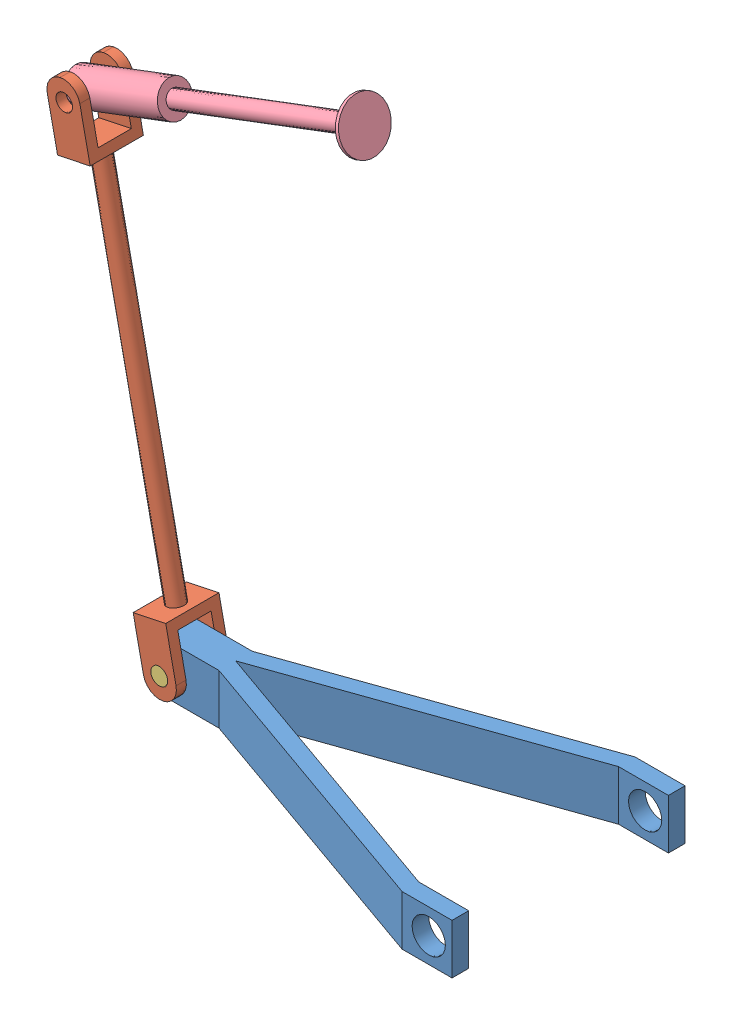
SolidWorks assembly 6.10. Subassembly.SLDASM, configuration Default (file format 9000). Lengths in mm.
Overall size (149.61 180.68 70).
4 component instances, 4 part files, 6 mates.
Components (placement in the parent):
- 6.10. Subassembly1-1: 6.10. Subassembly1.SLDPRT [Default] at origin size (120 15 70)
- 6.10. Subassembly2-1: 6.10. Subassembly2.SLDPRT [Default] at (-13.7616 -5.8708 0) x (-0.206402 0.978467 0) z (0 0 1) size (150 10 16)
- 6.10. Subassembly3-1: 6.10. Subassembly3.SLDPRT [Default] at (-15 0 0) x (0 0 1) z (-1 0 0) size (16 5.2 5.2)
- 6.10. Subassembly4-1: 6.10. Subassembly4.SLDPRT [Default] at (-46.2894 133.967 0) x (0.353819 -0.935314 0) z (0 0 1) size (15 91 15)
Mates (geometry in assembly coordinates):
- Concentric1: concentric aligned: cylinder of 6.10. Subassembly1-1 through (-15 0 -35) axis (0 0 1) radius 2.5; cylinder of 6.10. Subassembly2-1 through (-15 0 -8) axis (0 0 1) radius 2.5
- Width1: width anti-aligned: plane of 6.10. Subassembly2-1 through (-18.6539 -6.9028 5) normal (0 0 -1); plane of 6.10. Subassembly2-1 through (-18.6539 -6.9028 -5) normal (0 0 1); plane of 6.10. Subassembly1-1 through (0 7.5 5) normal (0 0 1); plane of 6.10. Subassembly1-1 through (0 7.5 -5) normal (0 0 -1)
- Concentric2: concentric anti-aligned: cylinder of 6.10. Subassembly1-1 through (-15 0 -35) axis (0 0 1) radius 2.5; cylinder of 6.10. Subassembly3-1 through (-15 0 8) axis (0 0 -1) radius 2.6
- Width2: width aligned: plane of 6.10. Subassembly2-1 through (-18.6539 -6.9028 8) normal (0 0 1); plane of 6.10. Subassembly2-1 through (-18.6539 -6.9028 -8) normal (0 0 -1); plane of 6.10. Subassembly3-1 through (-15 0 8) normal (0 0 1); plane of 6.10. Subassembly3-1 through (-15 0 -8) normal (0 0 -1)
- Concentric3: concentric aligned: cylinder of 6.10. Subassembly2-1 through (-43.4835 135.0285 -8) axis (0 0 1) radius 2.5; cylinder of 6.10. Subassembly4-1 through (-43.4835 135.0285 -7.5) axis (0 0 1) radius 2.5
- Width3: width: plane of 6.10. Subassembly2-1 through (-49.6142 139.8673 -5) normal (0 0 1); plane of 6.10. Subassembly2-1 through (-49.6142 139.8673 5) normal (0 0 -1); cylinder of 6.10. Subassembly4-1 through (-18.23 144.5816 0) axis (-0.935314 -0.353819 0) radius 5
